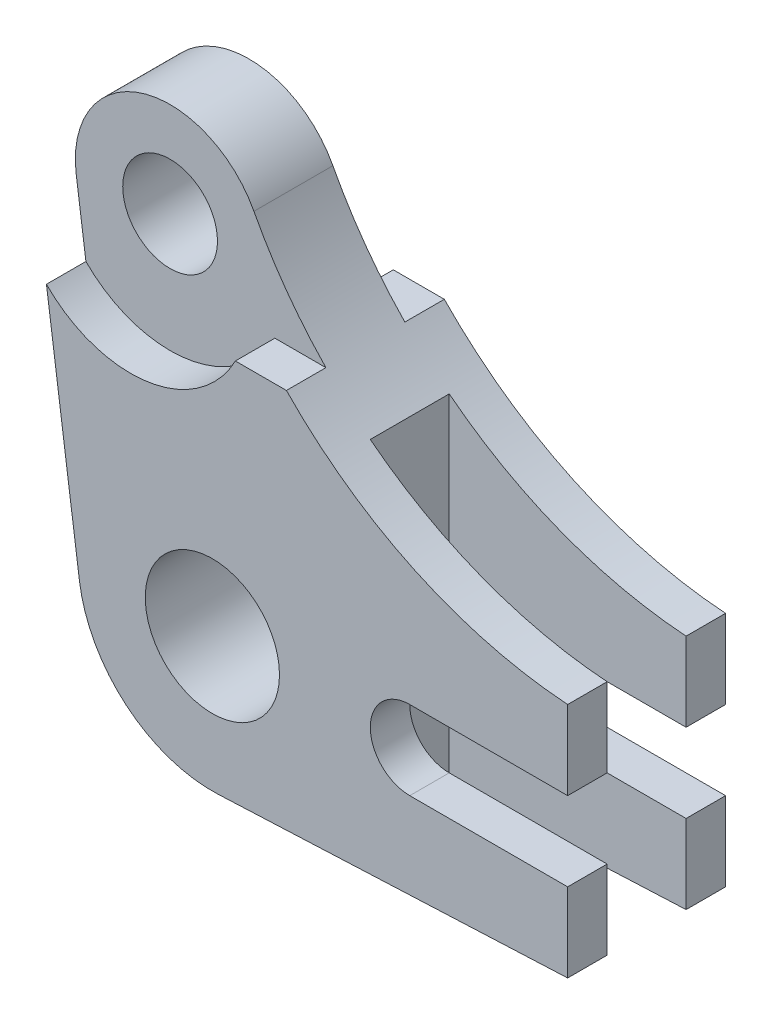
ISO-10303-21;
HEADER;
FILE_DESCRIPTION(('STEP AP214'),'2;1');
FILE_NAME('part.step','',(''),(''),'','','');
FILE_SCHEMA(('AUTOMOTIVE_DESIGN { 1 0 10303 214 1 1 1 1 }'));
ENDSEC;
DATA;
#1=APPLICATION_CONTEXT('core data for automotive mechanical design processes');
#2=APPLICATION_PROTOCOL_DEFINITION('international standard','automotive_design',2000,#1);
#3=PRODUCT_CONTEXT('',#1,'mechanical');
#4=PRODUCT('Part','Part','',(#3));
#5=PRODUCT_RELATED_PRODUCT_CATEGORY('part','',(#4));
#6=PRODUCT_DEFINITION_FORMATION('','',#4);
#7=PRODUCT_DEFINITION_CONTEXT('part definition',#1,'design');
#8=PRODUCT_DEFINITION('design','',#6,#7);
#9=PRODUCT_DEFINITION_SHAPE('','',#8);
#10=(LENGTH_UNIT() NAMED_UNIT(*) SI_UNIT(.MILLI.,.METRE.));
#11=(NAMED_UNIT(*) PLANE_ANGLE_UNIT() SI_UNIT($,.RADIAN.));
#12=(NAMED_UNIT(*) SI_UNIT($,.STERADIAN.) SOLID_ANGLE_UNIT());
#13=UNCERTAINTY_MEASURE_WITH_UNIT(LENGTH_MEASURE(1.E-05),#10,'distance_accuracy_value','');
#14=(GEOMETRIC_REPRESENTATION_CONTEXT(3) GLOBAL_UNCERTAINTY_ASSIGNED_CONTEXT((#13)) GLOBAL_UNIT_ASSIGNED_CONTEXT((#10,
#11,#12)) REPRESENTATION_CONTEXT('',''));
#15=CARTESIAN_POINT('',(0.,0.,0.));
#16=DIRECTION('',(0.,0.,1.));
#17=DIRECTION('',(1.,0.,0.));
#18=AXIS2_PLACEMENT_3D('',#15,#16,#17);
#19=CARTESIAN_POINT('',(57.15,-6.35,12.7));
#20=DIRECTION('',(-1.,0.,0.));
#21=DIRECTION('',(0.,-1.,0.));
#22=AXIS2_PLACEMENT_3D('',#19,#20,#21);
#23=PLANE('',#22);
#24=DIRECTION('',(0.,0.,-1.));
#25=VECTOR('',#24,1.);
#26=CARTESIAN_POINT('',(57.15,-19.05,12.7));
#27=LINE('',#26,#25);
#28=CARTESIAN_POINT('',(57.15,-19.05,12.7));
#29=VERTEX_POINT('',#28);
#30=CARTESIAN_POINT('',(57.15,-19.05,6.35));
#31=VERTEX_POINT('',#30);
#32=EDGE_CURVE('E237',#29,#31,#27,.T.);
#33=ORIENTED_EDGE('',*,*,#32,.T.);
#34=DIRECTION('',(0.,-1.,0.));
#35=VECTOR('',#34,1.);
#36=CARTESIAN_POINT('',(57.15,-21.5683436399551,6.35));
#37=LINE('',#36,#35);
#38=CARTESIAN_POINT('',(57.15,-6.35,6.35));
#39=VERTEX_POINT('',#38);
#40=EDGE_CURVE('E230',#39,#31,#37,.T.);
#41=ORIENTED_EDGE('',*,*,#40,.F.);
#42=DIRECTION('',(0.,0.,-1.));
#43=VECTOR('',#42,1.);
#44=CARTESIAN_POINT('',(57.15,-6.35,12.7));
#45=LINE('',#44,#43);
#46=CARTESIAN_POINT('',(57.15,-6.35,12.7));
#47=VERTEX_POINT('',#46);
#48=EDGE_CURVE('E238',#47,#39,#45,.T.);
#49=ORIENTED_EDGE('',*,*,#48,.F.);
#50=DIRECTION('',(0.,1.,0.));
#51=VECTOR('',#50,1.);
#52=CARTESIAN_POINT('',(57.15,-6.35,12.7));
#53=LINE('',#52,#51);
#54=EDGE_CURVE('E455',#29,#47,#53,.T.);
#55=ORIENTED_EDGE('',*,*,#54,.F.);
#56=EDGE_LOOP('',(#33,#41,#49,#55));
#57=FACE_BOUND('',#56,.T.);
#58=ADVANCED_FACE('F47',(#57),#23,.F.);
#59=CARTESIAN_POINT('',(31.75,-6.35,12.7));
#60=DIRECTION('',(0.,-1.,0.));
#61=DIRECTION('',(1.,0.,0.));
#62=AXIS2_PLACEMENT_3D('',#59,#60,#61);
#63=PLANE('',#62);
#64=ORIENTED_EDGE('',*,*,#48,.T.);
#65=DIRECTION('',(-1.,0.,0.));
#66=VECTOR('',#65,1.);
#67=CARTESIAN_POINT('',(31.75,-6.35,6.35));
#68=LINE('',#67,#66);
#69=CARTESIAN_POINT('',(31.75,-6.35,6.35));
#70=VERTEX_POINT('',#69);
#71=EDGE_CURVE('E582',#39,#70,#68,.T.);
#72=ORIENTED_EDGE('',*,*,#71,.T.);
#73=DIRECTION('',(0.,0.,-1.));
#74=VECTOR('',#73,1.);
#75=CARTESIAN_POINT('',(31.75,-6.35,12.7));
#76=LINE('',#75,#74);
#77=CARTESIAN_POINT('',(31.75,-6.35,12.7));
#78=VERTEX_POINT('',#77);
#79=EDGE_CURVE('E297',#78,#70,#76,.T.);
#80=ORIENTED_EDGE('',*,*,#79,.F.);
#81=DIRECTION('',(-1.,0.,0.));
#82=VECTOR('',#81,1.);
#83=CARTESIAN_POINT('',(31.75,-6.35,12.7));
#84=LINE('',#83,#82);
#85=EDGE_CURVE('E458',#47,#78,#84,.T.);
#86=ORIENTED_EDGE('',*,*,#85,.F.);
#87=EDGE_LOOP('',(#64,#72,#80,#86));
#88=FACE_BOUND('',#87,.T.);
#89=ADVANCED_FACE('F513',(#88),#63,.F.);
#90=CARTESIAN_POINT('',(31.75,0.,12.7));
#91=DIRECTION('',(0.,0.,-1.));
#92=DIRECTION('',(-1.,0.,0.));
#93=AXIS2_PLACEMENT_3D('',#90,#91,#92);
#94=CYLINDRICAL_SURFACE('',#93,6.35);
#95=ORIENTED_EDGE('',*,*,#79,.T.);
#96=CARTESIAN_POINT('',(31.75,0.,6.35));
#97=DIRECTION('',(0.,0.,1.));
#98=DIRECTION('',(1.,0.,0.));
#99=AXIS2_PLACEMENT_3D('',#96,#97,#98);
#100=CIRCLE('',#99,6.35);
#101=CARTESIAN_POINT('',(31.75,6.35,6.35));
#102=VERTEX_POINT('',#101);
#103=EDGE_CURVE('E579',#70,#102,#100,.F.);
#104=ORIENTED_EDGE('',*,*,#103,.T.);
#105=DIRECTION('',(0.,0.,-1.));
#106=VECTOR('',#105,1.);
#107=CARTESIAN_POINT('',(31.75,6.35,12.7));
#108=LINE('',#107,#106);
#109=CARTESIAN_POINT('',(31.75,6.35,12.7));
#110=VERTEX_POINT('',#109);
#111=EDGE_CURVE('E293',#110,#102,#108,.T.);
#112=ORIENTED_EDGE('',*,*,#111,.F.);
#113=CARTESIAN_POINT('',(31.75,0.,12.7));
#114=DIRECTION('',(0.,0.,-1.));
#115=DIRECTION('',(1.,0.,0.));
#116=AXIS2_PLACEMENT_3D('',#113,#114,#115);
#117=CIRCLE('',#116,6.35);
#118=EDGE_CURVE('E461',#78,#110,#117,.T.);
#119=ORIENTED_EDGE('',*,*,#118,.F.);
#120=EDGE_LOOP('',(#95,#104,#112,#119));
#121=FACE_BOUND('',#120,.T.);
#122=ADVANCED_FACE('F519',(#121),#94,.F.);
#123=CARTESIAN_POINT('',(31.75,6.35,12.7));
#124=DIRECTION('',(0.,1.,0.));
#125=DIRECTION('',(-1.,0.,0.));
#126=AXIS2_PLACEMENT_3D('',#123,#124,#125);
#127=PLANE('',#126);
#128=ORIENTED_EDGE('',*,*,#111,.T.);
#129=DIRECTION('',(1.,0.,0.));
#130=VECTOR('',#129,1.);
#131=CARTESIAN_POINT('',(31.75,6.35,6.35));
#132=LINE('',#131,#130);
#133=CARTESIAN_POINT('',(57.15,6.35,6.35));
#134=VERTEX_POINT('',#133);
#135=EDGE_CURVE('E578',#102,#134,#132,.T.);
#136=ORIENTED_EDGE('',*,*,#135,.T.);
#137=DIRECTION('',(0.,0.,-1.));
#138=VECTOR('',#137,1.);
#139=CARTESIAN_POINT('',(57.15,6.35,12.7));
#140=LINE('',#139,#138);
#141=CARTESIAN_POINT('',(57.15,6.35,12.7));
#142=VERTEX_POINT('',#141);
#143=EDGE_CURVE('E269',#142,#134,#140,.T.);
#144=ORIENTED_EDGE('',*,*,#143,.F.);
#145=DIRECTION('',(1.,0.,0.));
#146=VECTOR('',#145,1.);
#147=CARTESIAN_POINT('',(31.75,6.35,12.7));
#148=LINE('',#147,#146);
#149=EDGE_CURVE('E464',#110,#142,#148,.T.);
#150=ORIENTED_EDGE('',*,*,#149,.F.);
#151=EDGE_LOOP('',(#128,#136,#144,#150));
#152=FACE_BOUND('',#151,.T.);
#153=ADVANCED_FACE('F564',(#152),#127,.F.);
#154=CARTESIAN_POINT('',(57.15,6.35,12.7));
#155=DIRECTION('',(-1.,0.,0.));
#156=DIRECTION('',(0.,0.,1.));
#157=AXIS2_PLACEMENT_3D('',#154,#155,#156);
#158=PLANE('',#157);
#159=ORIENTED_EDGE('',*,*,#143,.T.);
#160=DIRECTION('',(0.,1.,0.));
#161=VECTOR('',#160,1.);
#162=CARTESIAN_POINT('',(57.15,6.35,6.35));
#163=LINE('',#162,#161);
#164=CARTESIAN_POINT('',(57.15,19.05,6.35));
#165=VERTEX_POINT('',#164);
#166=EDGE_CURVE('E56',#134,#165,#163,.T.);
#167=ORIENTED_EDGE('',*,*,#166,.T.);
#168=DIRECTION('',(0.,0.,-1.));
#169=VECTOR('',#168,1.);
#170=CARTESIAN_POINT('',(57.15,19.05,12.7));
#171=LINE('',#170,#169);
#172=CARTESIAN_POINT('',(57.15,19.05,12.7));
#173=VERTEX_POINT('',#172);
#174=EDGE_CURVE('E266',#173,#165,#171,.T.);
#175=ORIENTED_EDGE('',*,*,#174,.F.);
#176=DIRECTION('',(0.,1.,0.));
#177=VECTOR('',#176,1.);
#178=CARTESIAN_POINT('',(57.15,6.35,12.7));
#179=LINE('',#178,#177);
#180=EDGE_CURVE('E467',#142,#173,#179,.T.);
#181=ORIENTED_EDGE('',*,*,#180,.F.);
#182=EDGE_LOOP('',(#159,#167,#175,#181));
#183=FACE_BOUND('',#182,.T.);
#184=ADVANCED_FACE('F264',(#183),#158,.F.);
#185=CARTESIAN_POINT('',(-13.1480074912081,49.0690319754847,12.7));
#186=DIRECTION('',(0.,0.,-1.));
#187=DIRECTION('',(-1.,0.,0.));
#188=AXIS2_PLACEMENT_3D('',#185,#186,#187);
#189=CYLINDRICAL_SURFACE('',#188,15.24);
#190=CARTESIAN_POINT('',(-13.1480074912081,49.0690319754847,-6.35));
#191=DIRECTION('',(0.,0.,1.));
#192=DIRECTION('',(1.,0.,0.));
#193=AXIS2_PLACEMENT_3D('',#190,#191,#192);
#194=CIRCLE('',#193,15.24);
#195=CARTESIAN_POINT('',(0.336044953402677,56.1709985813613,-6.35));
#196=VERTEX_POINT('',#195);
#197=CARTESIAN_POINT('',(-28.2463090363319,46.9956553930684,-6.35));
#198=VERTEX_POINT('',#197);
#199=EDGE_CURVE('E366',#196,#198,#194,.T.);
#200=ORIENTED_EDGE('',*,*,#199,.T.);
#201=DIRECTION('',(0.,0.,-1.));
#202=VECTOR('',#201,1.);
#203=CARTESIAN_POINT('',(-28.2463090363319,46.9956553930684,12.7));
#204=LINE('',#203,#202);
#205=CARTESIAN_POINT('',(-28.2463090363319,46.9956553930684,6.35));
#206=VERTEX_POINT('',#205);
#207=EDGE_CURVE('E351',#206,#198,#204,.T.);
#208=ORIENTED_EDGE('',*,*,#207,.F.);
#209=CARTESIAN_POINT('',(-13.1480074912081,49.0690319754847,6.35));
#210=DIRECTION('',(0.,0.,1.));
#211=DIRECTION('',(1.,0.,0.));
#212=AXIS2_PLACEMENT_3D('',#209,#210,#211);
#213=CIRCLE('',#212,15.24);
#214=CARTESIAN_POINT('',(0.336044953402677,56.1709985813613,6.35));
#215=VERTEX_POINT('',#214);
#216=EDGE_CURVE('E367',#215,#206,#213,.T.);
#217=ORIENTED_EDGE('',*,*,#216,.F.);
#218=DIRECTION('',(0.,0.,-1.));
#219=VECTOR('',#218,1.);
#220=CARTESIAN_POINT('',(0.336044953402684,56.1709985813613,12.7));
#221=LINE('',#220,#219);
#222=EDGE_CURVE('E287',#215,#196,#221,.T.);
#223=ORIENTED_EDGE('',*,*,#222,.T.);
#224=EDGE_LOOP('',(#200,#208,#217,#223));
#225=FACE_BOUND('',#224,.T.);
#226=ADVANCED_FACE('F365',(#225),#189,.T.);
#227=CARTESIAN_POINT('',(-13.1480074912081,49.0690319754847,12.7));
#228=DIRECTION('',(0.,0.,-1.));
#229=DIRECTION('',(-1.,0.,0.));
#230=AXIS2_PLACEMENT_3D('',#227,#228,#229);
#231=CYLINDRICAL_SURFACE('',#230,7.62);
#232=CARTESIAN_POINT('',(-13.1480074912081,49.0690319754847,6.35));
#233=DIRECTION('',(0.,0.,1.));
#234=DIRECTION('',(1.,0.,0.));
#235=AXIS2_PLACEMENT_3D('',#232,#233,#234);
#236=CIRCLE('',#235,7.62);
#237=CARTESIAN_POINT('',(-5.5280074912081,49.0690319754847,6.35));
#238=VERTEX_POINT('',#237);
#239=EDGE_CURVE('E251',#238,#238,#236,.T.);
#240=ORIENTED_EDGE('',*,*,#239,.T.);
#241=EDGE_LOOP('',(#240));
#242=FACE_BOUND('',#241,.T.);
#243=CARTESIAN_POINT('',(-13.1480074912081,49.0690319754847,-6.35));
#244=DIRECTION('',(0.,0.,-1.));
#245=DIRECTION('',(-1.,0.,0.));
#246=AXIS2_PLACEMENT_3D('',#243,#244,#245);
#247=CIRCLE('',#246,7.62);
#248=CARTESIAN_POINT('',(-20.7680074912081,49.0690319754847,-6.35));
#249=VERTEX_POINT('',#248);
#250=EDGE_CURVE('E401',#249,#249,#247,.T.);
#251=ORIENTED_EDGE('',*,*,#250,.T.);
#252=EDGE_LOOP('',(#251));
#253=FACE_BOUND('',#252,.T.);
#254=ADVANCED_FACE('F550',(#242,#253),#231,.F.);
#255=CARTESIAN_POINT('',(0.,0.,-12.7));
#256=DIRECTION('',(0.,0.,1.));
#257=DIRECTION('',(1.,0.,0.));
#258=AXIS2_PLACEMENT_3D('',#255,#256,#257);
#259=PLANE('',#258);
#260=CARTESIAN_POINT('',(0.,0.,-12.7));
#261=DIRECTION('',(0.,0.,1.));
#262=DIRECTION('',(1.,0.,0.));
#263=AXIS2_PLACEMENT_3D('',#260,#261,#262);
#264=CIRCLE('',#263,10.795);
#265=CARTESIAN_POINT('',(10.795,0.,-12.7));
#266=VERTEX_POINT('',#265);
#267=EDGE_CURVE('E255',#266,#266,#264,.T.);
#268=ORIENTED_EDGE('',*,*,#267,.T.);
#269=EDGE_LOOP('',(#268));
#270=FACE_BOUND('',#269,.T.);
#271=CARTESIAN_POINT('',(-13.1480074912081,49.0690319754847,-12.7));
#272=DIRECTION('',(0.,0.,1.));
#273=DIRECTION('',(1.,0.,0.));
#274=AXIS2_PLACEMENT_3D('',#271,#272,#273);
#275=CIRCLE('',#274,19.05);
#276=CARTESIAN_POINT('',(-26.6912765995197,35.6719292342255,-12.7));
#277=VERTEX_POINT('',#276);
#278=CARTESIAN_POINT('',(3.70044644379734,40.1790319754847,-12.7));
#279=VERTEX_POINT('',#278);
#280=EDGE_CURVE('E381',#277,#279,#275,.T.);
#281=ORIENTED_EDGE('',*,*,#280,.T.);
#282=DIRECTION('',(1.,0.,0.));
#283=VECTOR('',#282,1.);
#284=CARTESIAN_POINT('',(11.9121226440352,40.1790319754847,-12.7));
#285=LINE('',#284,#283);
#286=CARTESIAN_POINT('',(11.9121226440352,40.1790319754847,-12.7));
#287=VERTEX_POINT('',#286);
#288=EDGE_CURVE('E390',#279,#287,#285,.T.);
#289=ORIENTED_EDGE('',*,*,#288,.T.);
#290=CARTESIAN_POINT('',(62.1379519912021,88.7216788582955,-12.7));
#291=DIRECTION('',(0.,0.,-1.));
#292=DIRECTION('',(1.,0.,0.));
#293=AXIS2_PLACEMENT_3D('',#290,#291,#292);
#294=CIRCLE('',#293,69.85);
#295=CARTESIAN_POINT('',(57.15,19.05,-12.7));
#296=VERTEX_POINT('',#295);
#297=EDGE_CURVE('E340',#296,#287,#294,.T.);
#298=ORIENTED_EDGE('',*,*,#297,.F.);
#299=DIRECTION('',(0.,1.,0.));
#300=VECTOR('',#299,1.);
#301=CARTESIAN_POINT('',(57.15,6.35,-12.7));
#302=LINE('',#301,#300);
#303=CARTESIAN_POINT('',(57.15,6.35,-12.7));
#304=VERTEX_POINT('',#303);
#305=EDGE_CURVE('E333',#304,#296,#302,.T.);
#306=ORIENTED_EDGE('',*,*,#305,.F.);
#307=DIRECTION('',(1.,0.,0.));
#308=VECTOR('',#307,1.);
#309=CARTESIAN_POINT('',(31.75,6.35,-12.7));
#310=LINE('',#309,#308);
#311=CARTESIAN_POINT('',(31.75,6.35,-12.7));
#312=VERTEX_POINT('',#311);
#313=EDGE_CURVE('E329',#312,#304,#310,.T.);
#314=ORIENTED_EDGE('',*,*,#313,.F.);
#315=CARTESIAN_POINT('',(31.75,0.,-12.7));
#316=DIRECTION('',(0.,0.,-1.));
#317=DIRECTION('',(1.,0.,0.));
#318=AXIS2_PLACEMENT_3D('',#315,#316,#317);
#319=CIRCLE('',#318,6.35);
#320=CARTESIAN_POINT('',(31.75,-6.35,-12.7));
#321=VERTEX_POINT('',#320);
#322=EDGE_CURVE('E314',#321,#312,#319,.T.);
#323=ORIENTED_EDGE('',*,*,#322,.F.);
#324=DIRECTION('',(-1.,0.,0.));
#325=VECTOR('',#324,1.);
#326=CARTESIAN_POINT('',(31.75,-6.35,-12.7));
#327=LINE('',#326,#325);
#328=CARTESIAN_POINT('',(57.15,-6.35,-12.7));
#329=VERTEX_POINT('',#328);
#330=EDGE_CURVE('E319',#329,#321,#327,.T.);
#331=ORIENTED_EDGE('',*,*,#330,.F.);
#332=DIRECTION('',(0.,1.,0.));
#333=VECTOR('',#332,1.);
#334=CARTESIAN_POINT('',(57.15,-6.35,-12.7));
#335=LINE('',#334,#333);
#336=CARTESIAN_POINT('',(57.15,-19.05,-12.7));
#337=VERTEX_POINT('',#336);
#338=EDGE_CURVE('E323',#337,#329,#335,.T.);
#339=ORIENTED_EDGE('',*,*,#338,.F.);
#340=DIRECTION('',(0.998996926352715,0.0447788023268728,0.));
#341=VECTOR('',#340,1.);
#342=CARTESIAN_POINT('',(57.15,-19.05,-12.7));
#343=LINE('',#342,#341);
#344=CARTESIAN_POINT('',(0.966774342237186,-21.5683436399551,-12.7));
#345=VERTEX_POINT('',#344);
#346=EDGE_CURVE('E234',#345,#337,#343,.T.);
#347=ORIENTED_EDGE('',*,*,#346,.F.);
#348=CARTESIAN_POINT('',(0.,0.,-12.7));
#349=DIRECTION('',(0.,0.,1.));
#350=DIRECTION('',(1.,0.,0.));
#351=AXIS2_PLACEMENT_3D('',#348,#349,#350);
#352=CIRCLE('',#351,21.59);
#353=CARTESIAN_POINT('',(-21.3892605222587,-2.93728349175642,-12.7));
#354=VERTEX_POINT('',#353);
#355=EDGE_CURVE('E445',#354,#345,#352,.T.);
#356=ORIENTED_EDGE('',*,*,#355,.F.);
#357=DIRECTION('',(0.136048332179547,-0.990702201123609,0.));
#358=VECTOR('',#357,1.);
#359=CARTESIAN_POINT('',(-28.2463090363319,46.9956553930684,-12.7));
#360=LINE('',#359,#358);
#361=EDGE_CURVE('E344',#277,#354,#360,.T.);
#362=ORIENTED_EDGE('',*,*,#361,.F.);
#363=EDGE_LOOP('',(#281,#289,#298,#306,#314,#323,#331,#339,#347,#356,#362));
#364=FACE_BOUND('',#363,.T.);
#365=ADVANCED_FACE('F326',(#270,#364),#259,.F.);
#366=CARTESIAN_POINT('',(62.1379519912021,88.7216788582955,12.7));
#367=DIRECTION('',(0.,0.,-1.));
#368=DIRECTION('',(-1.,0.,0.));
#369=AXIS2_PLACEMENT_3D('',#366,#367,#368);
#370=CYLINDRICAL_SURFACE('',#369,69.85);
#371=ORIENTED_EDGE('',*,*,#174,.T.);
#372=CARTESIAN_POINT('',(62.1379519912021,88.7216788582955,6.35));
#373=DIRECTION('',(0.,0.,1.));
#374=DIRECTION('',(1.,0.,0.));
#375=AXIS2_PLACEMENT_3D('',#372,#373,#374);
#376=CIRCLE('',#375,69.85);
#377=CARTESIAN_POINT('',(19.05,33.7448574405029,6.35));
#378=VERTEX_POINT('',#377);
#379=EDGE_CURVE('E276',#165,#378,#376,.F.);
#380=ORIENTED_EDGE('',*,*,#379,.T.);
#381=DIRECTION('',(0.,0.,-1.));
#382=VECTOR('',#381,1.);
#383=CARTESIAN_POINT('',(19.05,33.7448574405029,12.7));
#384=LINE('',#383,#382);
#385=CARTESIAN_POINT('',(19.05,33.7448574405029,-6.35));
#386=VERTEX_POINT('',#385);
#387=EDGE_CURVE('E394',#378,#386,#384,.T.);
#388=ORIENTED_EDGE('',*,*,#387,.T.);
#389=CARTESIAN_POINT('',(62.1379519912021,88.7216788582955,-6.35));
#390=DIRECTION('',(0.,0.,-1.));
#391=DIRECTION('',(-1.,0.,0.));
#392=AXIS2_PLACEMENT_3D('',#389,#390,#391);
#393=CIRCLE('',#392,69.85);
#394=CARTESIAN_POINT('',(57.15,19.05,-6.35));
#395=VERTEX_POINT('',#394);
#396=EDGE_CURVE('E218',#386,#395,#393,.F.);
#397=ORIENTED_EDGE('',*,*,#396,.T.);
#398=EDGE_CURVE('E282',#395,#296,#171,.T.);
#399=ORIENTED_EDGE('',*,*,#398,.T.);
#400=ORIENTED_EDGE('',*,*,#297,.T.);
#401=DIRECTION('',(0.,0.,-1.));
#402=VECTOR('',#401,1.);
#403=CARTESIAN_POINT('',(11.9121226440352,40.1790319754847,-6.35));
#404=LINE('',#403,#402);
#405=CARTESIAN_POINT('',(11.9121226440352,40.1790319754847,-6.35));
#406=VERTEX_POINT('',#405);
#407=EDGE_CURVE('E374',#406,#287,#404,.T.);
#408=ORIENTED_EDGE('',*,*,#407,.F.);
#409=CARTESIAN_POINT('',(62.1379519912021,88.7216788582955,-6.35));
#410=DIRECTION('',(0.,0.,-1.));
#411=DIRECTION('',(1.,0.,0.));
#412=AXIS2_PLACEMENT_3D('',#409,#410,#411);
#413=CIRCLE('',#412,69.85);
#414=EDGE_CURVE('E373',#406,#196,#413,.T.);
#415=ORIENTED_EDGE('',*,*,#414,.T.);
#416=ORIENTED_EDGE('',*,*,#222,.F.);
#417=CARTESIAN_POINT('',(62.1379519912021,88.7216788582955,6.35));
#418=DIRECTION('',(0.,0.,-1.));
#419=DIRECTION('',(1.,0.,0.));
#420=AXIS2_PLACEMENT_3D('',#417,#418,#419);
#421=CIRCLE('',#420,69.85);
#422=CARTESIAN_POINT('',(11.9121226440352,40.1790319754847,6.35));
#423=VERTEX_POINT('',#422);
#424=EDGE_CURVE('E370',#423,#215,#421,.T.);
#425=ORIENTED_EDGE('',*,*,#424,.F.);
#426=DIRECTION('',(0.,0.,1.));
#427=VECTOR('',#426,1.);
#428=CARTESIAN_POINT('',(11.9121226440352,40.1790319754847,6.35));
#429=LINE('',#428,#427);
#430=CARTESIAN_POINT('',(11.9121226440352,40.1790319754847,12.7));
#431=VERTEX_POINT('',#430);
#432=EDGE_CURVE('E256',#423,#431,#429,.T.);
#433=ORIENTED_EDGE('',*,*,#432,.T.);
#434=CARTESIAN_POINT('',(62.1379519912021,88.7216788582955,12.7));
#435=DIRECTION('',(0.,0.,-1.));
#436=DIRECTION('',(1.,0.,0.));
#437=AXIS2_PLACEMENT_3D('',#434,#435,#436);
#438=CIRCLE('',#437,69.85);
#439=EDGE_CURVE('E279',#173,#431,#438,.T.);
#440=ORIENTED_EDGE('',*,*,#439,.F.);
#441=EDGE_LOOP('',(#371,#380,#388,#397,#399,#400,#408,#415,#416,#425,#433,#440));
#442=FACE_BOUND('',#441,.T.);
#443=ADVANCED_FACE('F274',(#442),#370,.F.);
#444=CARTESIAN_POINT('',(-28.2463090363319,46.9956553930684,12.7));
#445=DIRECTION('',(0.990702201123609,0.136048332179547,0.));
#446=DIRECTION('',(-0.136048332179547,0.990702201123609,0.));
#447=AXIS2_PLACEMENT_3D('',#444,#445,#446);
#448=PLANE('',#447);
#449=DIRECTION('',(0.,0.,-1.));
#450=VECTOR('',#449,1.);
#451=CARTESIAN_POINT('',(-26.6912765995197,35.6719292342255,-6.35));
#452=LINE('',#451,#450);
#453=CARTESIAN_POINT('',(-26.6912765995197,35.6719292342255,-6.35));
#454=VERTEX_POINT('',#453);
#455=EDGE_CURVE('E397',#454,#277,#452,.T.);
#456=ORIENTED_EDGE('',*,*,#455,.T.);
#457=ORIENTED_EDGE('',*,*,#361,.T.);
#458=DIRECTION('',(0.,0.,-1.));
#459=VECTOR('',#458,1.);
#460=CARTESIAN_POINT('',(-21.3892605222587,-2.93728349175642,12.7));
#461=LINE('',#460,#459);
#462=CARTESIAN_POINT('',(-21.3892605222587,-2.93728349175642,12.7));
#463=VERTEX_POINT('',#462);
#464=EDGE_CURVE('E348',#463,#354,#461,.T.);
#465=ORIENTED_EDGE('',*,*,#464,.F.);
#466=DIRECTION('',(0.136048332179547,-0.990702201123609,0.));
#467=VECTOR('',#466,1.);
#468=CARTESIAN_POINT('',(-28.2463090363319,46.9956553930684,12.7));
#469=LINE('',#468,#467);
#470=CARTESIAN_POINT('',(-26.6912765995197,35.6719292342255,12.7));
#471=VERTEX_POINT('',#470);
#472=EDGE_CURVE('E352',#471,#463,#469,.T.);
#473=ORIENTED_EDGE('',*,*,#472,.F.);
#474=DIRECTION('',(0.,0.,1.));
#475=VECTOR('',#474,1.);
#476=CARTESIAN_POINT('',(-26.6912765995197,35.6719292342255,6.35));
#477=LINE('',#476,#475);
#478=CARTESIAN_POINT('',(-26.6912765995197,35.6719292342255,6.35));
#479=VERTEX_POINT('',#478);
#480=EDGE_CURVE('E428',#479,#471,#477,.T.);
#481=ORIENTED_EDGE('',*,*,#480,.F.);
#482=DIRECTION('',(0.136048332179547,-0.990702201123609,0.));
#483=VECTOR('',#482,1.);
#484=CARTESIAN_POINT('',(-28.2463090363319,46.9956553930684,6.35));
#485=LINE('',#484,#483);
#486=EDGE_CURVE('E413',#206,#479,#485,.T.);
#487=ORIENTED_EDGE('',*,*,#486,.F.);
#488=ORIENTED_EDGE('',*,*,#207,.T.);
#489=DIRECTION('',(0.136048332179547,-0.990702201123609,0.));
#490=VECTOR('',#489,1.);
#491=CARTESIAN_POINT('',(-28.2463090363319,46.9956553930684,-6.35));
#492=LINE('',#491,#490);
#493=EDGE_CURVE('E387',#198,#454,#492,.T.);
#494=ORIENTED_EDGE('',*,*,#493,.T.);
#495=EDGE_LOOP('',(#456,#457,#465,#473,#481,#487,#488,#494));
#496=FACE_BOUND('',#495,.T.);
#497=ADVANCED_FACE('F487',(#496),#448,.F.);
#498=CARTESIAN_POINT('',(0.,0.,12.7));
#499=DIRECTION('',(0.,0.,1.));
#500=DIRECTION('',(1.,0.,0.));
#501=AXIS2_PLACEMENT_3D('',#498,#499,#500);
#502=PLANE('',#501);
#503=DIRECTION('',(1.,0.,0.));
#504=VECTOR('',#503,1.);
#505=CARTESIAN_POINT('',(11.9121226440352,40.1790319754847,12.7));
#506=LINE('',#505,#504);
#507=CARTESIAN_POINT('',(3.70044644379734,40.1790319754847,12.7));
#508=VERTEX_POINT('',#507);
#509=EDGE_CURVE('E414',#508,#431,#506,.T.);
#510=ORIENTED_EDGE('',*,*,#509,.F.);
#511=CARTESIAN_POINT('',(-13.1480074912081,49.0690319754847,12.7));
#512=DIRECTION('',(0.,0.,1.));
#513=DIRECTION('',(1.,0.,0.));
#514=AXIS2_PLACEMENT_3D('',#511,#512,#513);
#515=CIRCLE('',#514,19.05);
#516=EDGE_CURVE('E410',#471,#508,#515,.T.);
#517=ORIENTED_EDGE('',*,*,#516,.F.);
#518=ORIENTED_EDGE('',*,*,#472,.T.);
#519=CARTESIAN_POINT('',(0.,0.,12.7));
#520=DIRECTION('',(0.,0.,1.));
#521=DIRECTION('',(1.,0.,0.));
#522=AXIS2_PLACEMENT_3D('',#519,#520,#521);
#523=CIRCLE('',#522,21.59);
#524=CARTESIAN_POINT('',(0.966774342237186,-21.5683436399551,12.7));
#525=VERTEX_POINT('',#524);
#526=EDGE_CURVE('E347',#463,#525,#523,.T.);
#527=ORIENTED_EDGE('',*,*,#526,.T.);
#528=DIRECTION('',(0.998996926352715,0.0447788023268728,0.));
#529=VECTOR('',#528,1.);
#530=CARTESIAN_POINT('',(57.15,-19.05,12.7));
#531=LINE('',#530,#529);
#532=EDGE_CURVE('E452',#525,#29,#531,.T.);
#533=ORIENTED_EDGE('',*,*,#532,.T.);
#534=ORIENTED_EDGE('',*,*,#54,.T.);
#535=ORIENTED_EDGE('',*,*,#85,.T.);
#536=ORIENTED_EDGE('',*,*,#118,.T.);
#537=ORIENTED_EDGE('',*,*,#149,.T.);
#538=ORIENTED_EDGE('',*,*,#180,.T.);
#539=ORIENTED_EDGE('',*,*,#439,.T.);
#540=EDGE_LOOP('',(#510,#517,#518,#527,#533,#534,#535,#536,#537,#538,#539));
#541=FACE_BOUND('',#540,.T.);
#542=CARTESIAN_POINT('',(0.,0.,12.7));
#543=DIRECTION('',(0.,0.,1.));
#544=DIRECTION('',(1.,0.,0.));
#545=AXIS2_PLACEMENT_3D('',#542,#543,#544);
#546=CIRCLE('',#545,10.795);
#547=CARTESIAN_POINT('',(10.795,0.,12.7));
#548=VERTEX_POINT('',#547);
#549=EDGE_CURVE('E441',#548,#548,#546,.T.);
#550=ORIENTED_EDGE('',*,*,#549,.F.);
#551=EDGE_LOOP('',(#550));
#552=FACE_BOUND('',#551,.T.);
#553=ADVANCED_FACE('F531',(#541,#552),#502,.T.);
#554=CARTESIAN_POINT('',(0.,0.,12.7));
#555=DIRECTION('',(0.,0.,-1.));
#556=DIRECTION('',(-1.,0.,0.));
#557=AXIS2_PLACEMENT_3D('',#554,#555,#556);
#558=CYLINDRICAL_SURFACE('',#557,21.59);
#559=ORIENTED_EDGE('',*,*,#355,.T.);
#560=DIRECTION('',(0.,0.,-1.));
#561=VECTOR('',#560,1.);
#562=CARTESIAN_POINT('',(0.966774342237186,-21.5683436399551,12.7));
#563=LINE('',#562,#561);
#564=EDGE_CURVE('E243',#525,#345,#563,.T.);
#565=ORIENTED_EDGE('',*,*,#564,.F.);
#566=ORIENTED_EDGE('',*,*,#526,.F.);
#567=ORIENTED_EDGE('',*,*,#464,.T.);
#568=EDGE_LOOP('',(#559,#565,#566,#567));
#569=FACE_BOUND('',#568,.T.);
#570=ADVANCED_FACE('F49',(#569),#558,.T.);
#571=CARTESIAN_POINT('',(57.15,-19.05,12.7));
#572=DIRECTION('',(-0.0447788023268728,0.998996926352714,0.));
#573=DIRECTION('',(-0.998996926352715,-0.0447788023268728,0.));
#574=AXIS2_PLACEMENT_3D('',#571,#572,#573);
#575=PLANE('',#574);
#576=DIRECTION('',(0.,0.,1.));
#577=VECTOR('',#576,1.);
#578=CARTESIAN_POINT('',(19.05,-20.757785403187,12.7));
#579=LINE('',#578,#577);
#580=CARTESIAN_POINT('',(19.05,-20.757785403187,-6.35));
#581=VERTEX_POINT('',#580);
#582=CARTESIAN_POINT('',(19.05,-20.757785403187,6.35));
#583=VERTEX_POINT('',#582);
#584=EDGE_CURVE('E11',#581,#583,#579,.T.);
#585=ORIENTED_EDGE('',*,*,#584,.T.);
#586=DIRECTION('',(0.998996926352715,0.0447788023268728,0.));
#587=VECTOR('',#586,1.);
#588=CARTESIAN_POINT('',(57.15,-19.05,6.35));
#589=LINE('',#588,#587);
#590=EDGE_CURVE('E586',#583,#31,#589,.T.);
#591=ORIENTED_EDGE('',*,*,#590,.T.);
#592=ORIENTED_EDGE('',*,*,#32,.F.);
#593=ORIENTED_EDGE('',*,*,#532,.F.);
#594=ORIENTED_EDGE('',*,*,#564,.T.);
#595=ORIENTED_EDGE('',*,*,#346,.T.);
#596=CARTESIAN_POINT('',(57.15,-19.05,-6.35));
#597=VERTEX_POINT('',#596);
#598=EDGE_CURVE('E225',#597,#337,#27,.T.);
#599=ORIENTED_EDGE('',*,*,#598,.F.);
#600=DIRECTION('',(-0.998996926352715,-0.0447788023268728,0.));
#601=VECTOR('',#600,1.);
#602=CARTESIAN_POINT('',(57.15,-19.05,-6.35));
#603=LINE('',#602,#601);
#604=EDGE_CURVE('E208',#597,#581,#603,.T.);
#605=ORIENTED_EDGE('',*,*,#604,.T.);
#606=EDGE_LOOP('',(#585,#591,#592,#593,#594,#595,#599,#605));
#607=FACE_BOUND('',#606,.T.);
#608=ADVANCED_FACE('F232',(#607),#575,.F.);
#609=CARTESIAN_POINT('',(57.15,-6.35,-6.35));
#610=VERTEX_POINT('',#609);
#611=EDGE_CURVE('E227',#610,#329,#45,.T.);
#612=ORIENTED_EDGE('',*,*,#611,.F.);
#613=DIRECTION('',(0.,1.,0.));
#614=VECTOR('',#613,1.);
#615=CARTESIAN_POINT('',(57.15,-21.5683436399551,-6.35));
#616=LINE('',#615,#614);
#617=EDGE_CURVE('E211',#597,#610,#616,.T.);
#618=ORIENTED_EDGE('',*,*,#617,.F.);
#619=ORIENTED_EDGE('',*,*,#598,.T.);
#620=ORIENTED_EDGE('',*,*,#338,.T.);
#621=EDGE_LOOP('',(#612,#618,#619,#620));
#622=FACE_BOUND('',#621,.T.);
#623=ADVANCED_FACE('F223',(#622),#23,.F.);
#624=CARTESIAN_POINT('',(31.75,-6.35,-6.35));
#625=VERTEX_POINT('',#624);
#626=EDGE_CURVE('E296',#625,#321,#76,.T.);
#627=ORIENTED_EDGE('',*,*,#626,.F.);
#628=DIRECTION('',(1.,0.,0.));
#629=VECTOR('',#628,1.);
#630=CARTESIAN_POINT('',(31.75,-6.35,-6.35));
#631=LINE('',#630,#629);
#632=EDGE_CURVE('E219',#625,#610,#631,.T.);
#633=ORIENTED_EDGE('',*,*,#632,.T.);
#634=ORIENTED_EDGE('',*,*,#611,.T.);
#635=ORIENTED_EDGE('',*,*,#330,.T.);
#636=EDGE_LOOP('',(#627,#633,#634,#635));
#637=FACE_BOUND('',#636,.T.);
#638=ADVANCED_FACE('F320',(#637),#63,.F.);
#639=CARTESIAN_POINT('',(31.75,6.35,-6.35));
#640=VERTEX_POINT('',#639);
#641=EDGE_CURVE('E292',#640,#312,#108,.T.);
#642=ORIENTED_EDGE('',*,*,#641,.F.);
#643=CARTESIAN_POINT('',(31.75,0.,-6.35));
#644=DIRECTION('',(0.,0.,-1.));
#645=DIRECTION('',(-1.,0.,0.));
#646=AXIS2_PLACEMENT_3D('',#643,#644,#645);
#647=CIRCLE('',#646,6.35);
#648=EDGE_CURVE('E316',#640,#625,#647,.F.);
#649=ORIENTED_EDGE('',*,*,#648,.T.);
#650=ORIENTED_EDGE('',*,*,#626,.T.);
#651=ORIENTED_EDGE('',*,*,#322,.T.);
#652=EDGE_LOOP('',(#642,#649,#650,#651));
#653=FACE_BOUND('',#652,.T.);
#654=ADVANCED_FACE('F312',(#653),#94,.F.);
#655=CARTESIAN_POINT('',(57.15,6.35,-6.35));
#656=VERTEX_POINT('',#655);
#657=EDGE_CURVE('E281',#656,#304,#140,.T.);
#658=ORIENTED_EDGE('',*,*,#657,.F.);
#659=DIRECTION('',(-1.,0.,0.));
#660=VECTOR('',#659,1.);
#661=CARTESIAN_POINT('',(31.75,6.35,-6.35));
#662=LINE('',#661,#660);
#663=EDGE_CURVE('E63',#656,#640,#662,.T.);
#664=ORIENTED_EDGE('',*,*,#663,.T.);
#665=ORIENTED_EDGE('',*,*,#641,.T.);
#666=ORIENTED_EDGE('',*,*,#313,.T.);
#667=EDGE_LOOP('',(#658,#664,#665,#666));
#668=FACE_BOUND('',#667,.T.);
#669=ADVANCED_FACE('F559',(#668),#127,.F.);
#670=ORIENTED_EDGE('',*,*,#398,.F.);
#671=DIRECTION('',(0.,-1.,0.));
#672=VECTOR('',#671,1.);
#673=CARTESIAN_POINT('',(57.15,6.35,-6.35));
#674=LINE('',#673,#672);
#675=EDGE_CURVE('E250',#395,#656,#674,.T.);
#676=ORIENTED_EDGE('',*,*,#675,.T.);
#677=ORIENTED_EDGE('',*,*,#657,.T.);
#678=ORIENTED_EDGE('',*,*,#305,.T.);
#679=EDGE_LOOP('',(#670,#676,#677,#678));
#680=FACE_BOUND('',#679,.T.);
#681=ADVANCED_FACE('F556',(#680),#158,.F.);
#682=CARTESIAN_POINT('',(0.,0.,12.7));
#683=DIRECTION('',(0.,0.,-1.));
#684=DIRECTION('',(-1.,0.,0.));
#685=AXIS2_PLACEMENT_3D('',#682,#683,#684);
#686=CYLINDRICAL_SURFACE('',#685,10.795);
#687=ORIENTED_EDGE('',*,*,#549,.T.);
#688=EDGE_LOOP('',(#687));
#689=FACE_BOUND('',#688,.T.);
#690=ORIENTED_EDGE('',*,*,#267,.F.);
#691=EDGE_LOOP('',(#690));
#692=FACE_BOUND('',#691,.T.);
#693=ADVANCED_FACE('F547',(#689,#692),#686,.F.);
#694=CARTESIAN_POINT('',(11.9121226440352,40.1790319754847,6.35));
#695=DIRECTION('',(0.,-1.,0.));
#696=DIRECTION('',(1.,0.,0.));
#697=AXIS2_PLACEMENT_3D('',#694,#695,#696);
#698=PLANE('',#697);
#699=ORIENTED_EDGE('',*,*,#509,.T.);
#700=ORIENTED_EDGE('',*,*,#432,.F.);
#701=DIRECTION('',(1.,0.,0.));
#702=VECTOR('',#701,1.);
#703=CARTESIAN_POINT('',(11.9121226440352,40.1790319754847,6.35));
#704=LINE('',#703,#702);
#705=CARTESIAN_POINT('',(3.70044644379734,40.1790319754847,6.35));
#706=VERTEX_POINT('',#705);
#707=EDGE_CURVE('E422',#706,#423,#704,.T.);
#708=ORIENTED_EDGE('',*,*,#707,.F.);
#709=DIRECTION('',(0.,0.,1.));
#710=VECTOR('',#709,1.);
#711=CARTESIAN_POINT('',(3.70044644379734,40.1790319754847,6.35));
#712=LINE('',#711,#710);
#713=EDGE_CURVE('E436',#706,#508,#712,.T.);
#714=ORIENTED_EDGE('',*,*,#713,.T.);
#715=EDGE_LOOP('',(#699,#700,#708,#714));
#716=FACE_BOUND('',#715,.T.);
#717=ADVANCED_FACE('F626',(#716),#698,.F.);
#718=CARTESIAN_POINT('',(-13.1480074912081,49.0690319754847,6.35));
#719=DIRECTION('',(0.,0.,1.));
#720=DIRECTION('',(1.,0.,0.));
#721=AXIS2_PLACEMENT_3D('',#718,#719,#720);
#722=CYLINDRICAL_SURFACE('',#721,19.05);
#723=ORIENTED_EDGE('',*,*,#516,.T.);
#724=ORIENTED_EDGE('',*,*,#713,.F.);
#725=CARTESIAN_POINT('',(-13.1480074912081,49.0690319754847,6.35));
#726=DIRECTION('',(0.,0.,1.));
#727=DIRECTION('',(1.,0.,0.));
#728=AXIS2_PLACEMENT_3D('',#725,#726,#727);
#729=CIRCLE('',#728,19.05);
#730=EDGE_CURVE('E418',#479,#706,#729,.T.);
#731=ORIENTED_EDGE('',*,*,#730,.F.);
#732=ORIENTED_EDGE('',*,*,#480,.T.);
#733=EDGE_LOOP('',(#723,#724,#731,#732));
#734=FACE_BOUND('',#733,.T.);
#735=ADVANCED_FACE('F621',(#734),#722,.F.);
#736=CARTESIAN_POINT('',(-13.1480074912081,49.0690319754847,6.35));
#737=DIRECTION('',(0.,0.,1.));
#738=DIRECTION('',(1.,0.,0.));
#739=AXIS2_PLACEMENT_3D('',#736,#737,#738);
#740=PLANE('',#739);
#741=ORIENTED_EDGE('',*,*,#239,.F.);
#742=EDGE_LOOP('',(#741));
#743=FACE_BOUND('',#742,.T.);
#744=ORIENTED_EDGE('',*,*,#216,.T.);
#745=ORIENTED_EDGE('',*,*,#486,.T.);
#746=ORIENTED_EDGE('',*,*,#730,.T.);
#747=ORIENTED_EDGE('',*,*,#707,.T.);
#748=ORIENTED_EDGE('',*,*,#424,.T.);
#749=EDGE_LOOP('',(#744,#745,#746,#747,#748));
#750=FACE_BOUND('',#749,.T.);
#751=ADVANCED_FACE('F624',(#743,#750),#740,.T.);
#752=CARTESIAN_POINT('',(-13.1480074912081,49.0690319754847,-6.35));
#753=DIRECTION('',(0.,0.,-1.));
#754=DIRECTION('',(-1.,0.,0.));
#755=AXIS2_PLACEMENT_3D('',#752,#753,#754);
#756=CYLINDRICAL_SURFACE('',#755,19.05);
#757=ORIENTED_EDGE('',*,*,#280,.F.);
#758=ORIENTED_EDGE('',*,*,#455,.F.);
#759=CARTESIAN_POINT('',(-13.1480074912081,49.0690319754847,-6.35));
#760=DIRECTION('',(0.,0.,1.));
#761=DIRECTION('',(1.,0.,0.));
#762=AXIS2_PLACEMENT_3D('',#759,#760,#761);
#763=CIRCLE('',#762,19.05);
#764=CARTESIAN_POINT('',(3.70044644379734,40.1790319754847,-6.35));
#765=VERTEX_POINT('',#764);
#766=EDGE_CURVE('E71',#454,#765,#763,.T.);
#767=ORIENTED_EDGE('',*,*,#766,.T.);
#768=DIRECTION('',(0.,0.,-1.));
#769=VECTOR('',#768,1.);
#770=CARTESIAN_POINT('',(3.70044644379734,40.1790319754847,-6.35));
#771=LINE('',#770,#769);
#772=EDGE_CURVE('E402',#765,#279,#771,.T.);
#773=ORIENTED_EDGE('',*,*,#772,.T.);
#774=EDGE_LOOP('',(#757,#758,#767,#773));
#775=FACE_BOUND('',#774,.T.);
#776=ADVANCED_FACE('F492',(#775),#756,.F.);
#777=CARTESIAN_POINT('',(11.9121226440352,40.1790319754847,-6.35));
#778=DIRECTION('',(0.,1.,0.));
#779=DIRECTION('',(-1.,0.,0.));
#780=AXIS2_PLACEMENT_3D('',#777,#778,#779);
#781=PLANE('',#780);
#782=ORIENTED_EDGE('',*,*,#288,.F.);
#783=ORIENTED_EDGE('',*,*,#772,.F.);
#784=DIRECTION('',(1.,0.,0.));
#785=VECTOR('',#784,1.);
#786=CARTESIAN_POINT('',(11.9121226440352,40.1790319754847,-6.35));
#787=LINE('',#786,#785);
#788=EDGE_CURVE('E376',#765,#406,#787,.T.);
#789=ORIENTED_EDGE('',*,*,#788,.T.);
#790=ORIENTED_EDGE('',*,*,#407,.T.);
#791=EDGE_LOOP('',(#782,#783,#789,#790));
#792=FACE_BOUND('',#791,.T.);
#793=ADVANCED_FACE('F495',(#792),#781,.T.);
#794=CARTESIAN_POINT('',(-13.1480074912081,49.0690319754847,-6.35));
#795=DIRECTION('',(0.,0.,-1.));
#796=DIRECTION('',(1.,0.,0.));
#797=AXIS2_PLACEMENT_3D('',#794,#795,#796);
#798=PLANE('',#797);
#799=ORIENTED_EDGE('',*,*,#250,.F.);
#800=EDGE_LOOP('',(#799));
#801=FACE_BOUND('',#800,.T.);
#802=ORIENTED_EDGE('',*,*,#199,.F.);
#803=ORIENTED_EDGE('',*,*,#414,.F.);
#804=ORIENTED_EDGE('',*,*,#788,.F.);
#805=ORIENTED_EDGE('',*,*,#766,.F.);
#806=ORIENTED_EDGE('',*,*,#493,.F.);
#807=EDGE_LOOP('',(#802,#803,#804,#805,#806));
#808=FACE_BOUND('',#807,.T.);
#809=ADVANCED_FACE('F496',(#801,#808),#798,.T.);
#810=CARTESIAN_POINT('',(19.05,0.,0.));
#811=DIRECTION('',(-1.,0.,0.));
#812=DIRECTION('',(0.,-1.,0.));
#813=AXIS2_PLACEMENT_3D('',#810,#811,#812);
#814=PLANE('',#813);
#815=DIRECTION('',(0.,-1.,0.));
#816=VECTOR('',#815,1.);
#817=CARTESIAN_POINT('',(19.05,-21.5683436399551,6.35));
#818=LINE('',#817,#816);
#819=EDGE_CURVE('E229',#378,#583,#818,.T.);
#820=ORIENTED_EDGE('',*,*,#819,.T.);
#821=ORIENTED_EDGE('',*,*,#584,.F.);
#822=DIRECTION('',(0.,1.,0.));
#823=VECTOR('',#822,1.);
#824=CARTESIAN_POINT('',(19.05,-21.5683436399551,-6.35));
#825=LINE('',#824,#823);
#826=EDGE_CURVE('E214',#581,#386,#825,.T.);
#827=ORIENTED_EDGE('',*,*,#826,.T.);
#828=ORIENTED_EDGE('',*,*,#387,.F.);
#829=EDGE_LOOP('',(#820,#821,#827,#828));
#830=FACE_BOUND('',#829,.T.);
#831=ADVANCED_FACE('F498',(#830),#814,.F.);
#832=CARTESIAN_POINT('',(19.05,-21.5683436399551,6.35));
#833=DIRECTION('',(0.,0.,1.));
#834=DIRECTION('',(1.,0.,0.));
#835=AXIS2_PLACEMENT_3D('',#832,#833,#834);
#836=PLANE('',#835);
#837=ORIENTED_EDGE('',*,*,#166,.F.);
#838=ORIENTED_EDGE('',*,*,#135,.F.);
#839=ORIENTED_EDGE('',*,*,#103,.F.);
#840=ORIENTED_EDGE('',*,*,#71,.F.);
#841=ORIENTED_EDGE('',*,*,#40,.T.);
#842=ORIENTED_EDGE('',*,*,#590,.F.);
#843=ORIENTED_EDGE('',*,*,#819,.F.);
#844=ORIENTED_EDGE('',*,*,#379,.F.);
#845=EDGE_LOOP('',(#837,#838,#839,#840,#841,#842,#843,#844));
#846=FACE_BOUND('',#845,.T.);
#847=ADVANCED_FACE('F506',(#846),#836,.F.);
#848=CARTESIAN_POINT('',(19.05,-21.5683436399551,-6.35));
#849=DIRECTION('',(0.,0.,-1.));
#850=DIRECTION('',(-1.,0.,0.));
#851=AXIS2_PLACEMENT_3D('',#848,#849,#850);
#852=PLANE('',#851);
#853=ORIENTED_EDGE('',*,*,#826,.F.);
#854=ORIENTED_EDGE('',*,*,#604,.F.);
#855=ORIENTED_EDGE('',*,*,#617,.T.);
#856=ORIENTED_EDGE('',*,*,#632,.F.);
#857=ORIENTED_EDGE('',*,*,#648,.F.);
#858=ORIENTED_EDGE('',*,*,#663,.F.);
#859=ORIENTED_EDGE('',*,*,#675,.F.);
#860=ORIENTED_EDGE('',*,*,#396,.F.);
#861=EDGE_LOOP('',(#853,#854,#855,#856,#857,#858,#859,#860));
#862=FACE_BOUND('',#861,.T.);
#863=ADVANCED_FACE('F210',(#862),#852,.F.);
#864=CLOSED_SHELL('',(#58,#89,#122,#153,#184,#226,#254,#365,#443,#497,#553,#570,#608,#623,#638,
#654,#669,#681,#693,#717,#735,#751,#776,#793,#809,#831,#847,#863));
#865=MANIFOLD_SOLID_BREP('B2',#864);
#866=ADVANCED_BREP_SHAPE_REPRESENTATION('',(#18,#865),#14);
#867=SHAPE_DEFINITION_REPRESENTATION(#9,#866);
ENDSEC;
END-ISO-10303-21;
